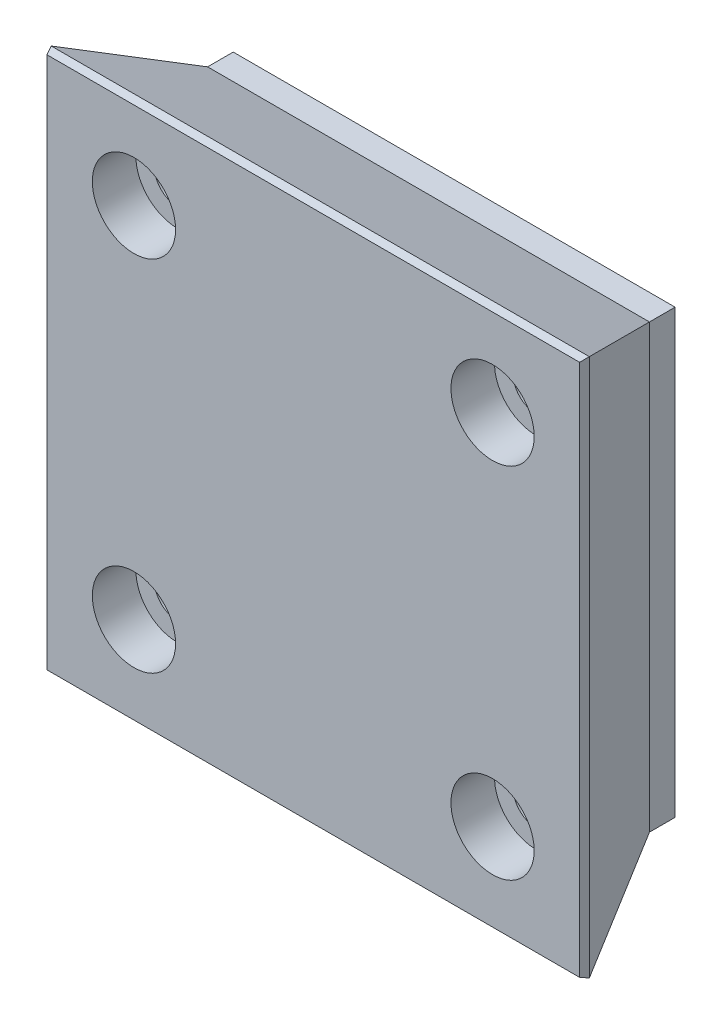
from build123d import *
from OCP.BRepFilletAPI import BRepFilletAPI_MakeChamfer

# Parameters (mm, degrees)
SKIZZE1_W                                            = 34.5
SKIZZE1_H                                            = 34.5
AUFSATZ_LINEAR_AUSTRAGEN1_DEPTH                      = 2
FASE1_SIZE                                           = 0.6
FASE1_SIZE2                                          = 0.454562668
STIRNSENKUNG_F_R_M3_ZYLINDERSCHRAUBE_MIT_D           = 3.6
STIRNSENKUNG_F_R_M3_ZYLINDERSCHRAUBE_MIT_CBORE_D     = 6.5
STIRNSENKUNG_F_R_M3_ZYLINDERSCHRAUBE_MIT_CBORE_DEPTH = 3.4


with BuildPart() as part:
    # Skizze1 → Aufsatz-Linear austragen1 (new body)
    with BuildSketch(Plane.XY):
        Rectangle(SKIZZE1_W, SKIZZE1_H)
    extrude(amount=AUFSATZ_LINEAR_AUSTRAGEN1_DEPTH)

    # Skizze2 → section 0 of ausformung1
    with BuildSketch(Plane.XY.offset(11), mode=Mode.PRIVATE) as ausformung1_s0:
        with BuildLine():
            Line((-21.25, -21.25), (21.25, -21.25))
            Line((21.25, -21.25), (21.25, 21.25))
            Line((21.25, 21.25), (-21.25, 21.25))
            Line((-21.25, 21.25), (-21.25, -21.25))
        make_face()
    # loft up to a face of the part (ausformung1)
    loft([ausformung1_s0.sketch, part.faces().sort_by_distance((0, 0, 2))[0]])

    # Fase1: one chamfer whose edges measure the first distance from different faces: ONE call of the kernel's chamfer builder (chamfer() names one face for all edges)
    fase1_edges_1 = [part.edges().sort_by_distance(p)[0] for p in [
        (0, -21.25, 11),
    ]]
    fase1_side_1 = [part.faces().sort_by_distance(p)[0] for p in [
        (0, -19.319264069, 6.655844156),
    ]]
    fase1_edges_2 = [part.edges().sort_by_distance(p)[0] for p in [
        (-21.25, 0, 11),
    ]]
    fase1_side_2 = [part.faces().sort_by_distance(p)[0] for p in [
        (-19.319264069, 0, 6.655844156),
    ]]
    fase1_edges_3 = [part.edges().sort_by_distance(p)[0] for p in [
        (0, 21.25, 11),
    ]]
    fase1_side_3 = [part.faces().sort_by_distance(p)[0] for p in [
        (0, 19.319264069, 6.655844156),
    ]]
    fase1_edges_4 = [part.edges().sort_by_distance(p)[0] for p in [
        (21.25, 0, 11),
    ]]
    fase1_side_4 = [part.faces().sort_by_distance(p)[0] for p in [
        (19.319264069, 0, 6.655844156),
    ]]
    fase1 = BRepFilletAPI_MakeChamfer(part.part.solid().wrapped)
    for e in fase1_edges_1:
        fase1.Add(FASE1_SIZE, FASE1_SIZE2, e.wrapped, fase1_side_1[0].wrapped)  # the first distance lies on this face
    for e in fase1_edges_2:
        fase1.Add(FASE1_SIZE, FASE1_SIZE2, e.wrapped, fase1_side_2[0].wrapped)  # the first distance lies on this face
    for e in fase1_edges_3:
        fase1.Add(FASE1_SIZE, FASE1_SIZE2, e.wrapped, fase1_side_3[0].wrapped)  # the first distance lies on this face
    for e in fase1_edges_4:
        fase1.Add(FASE1_SIZE, FASE1_SIZE2, e.wrapped, fase1_side_4[0].wrapped)  # the first distance lies on this face
    add(Compound.cast(fase1.Shape()), mode=Mode.REPLACE)

    # Stirnsenkung f_r M3 Zylinderschraube mit (through all)
    with Locations(Plane.XY.offset(11)):
        with Locations((-14, 14), (14, 14), (14, -14), (-14, -14)):
            CounterBoreHole(STIRNSENKUNG_F_R_M3_ZYLINDERSCHRAUBE_MIT_D / 2, STIRNSENKUNG_F_R_M3_ZYLINDERSCHRAUBE_MIT_CBORE_D / 2, STIRNSENKUNG_F_R_M3_ZYLINDERSCHRAUBE_MIT_CBORE_DEPTH)


solid = part.part
